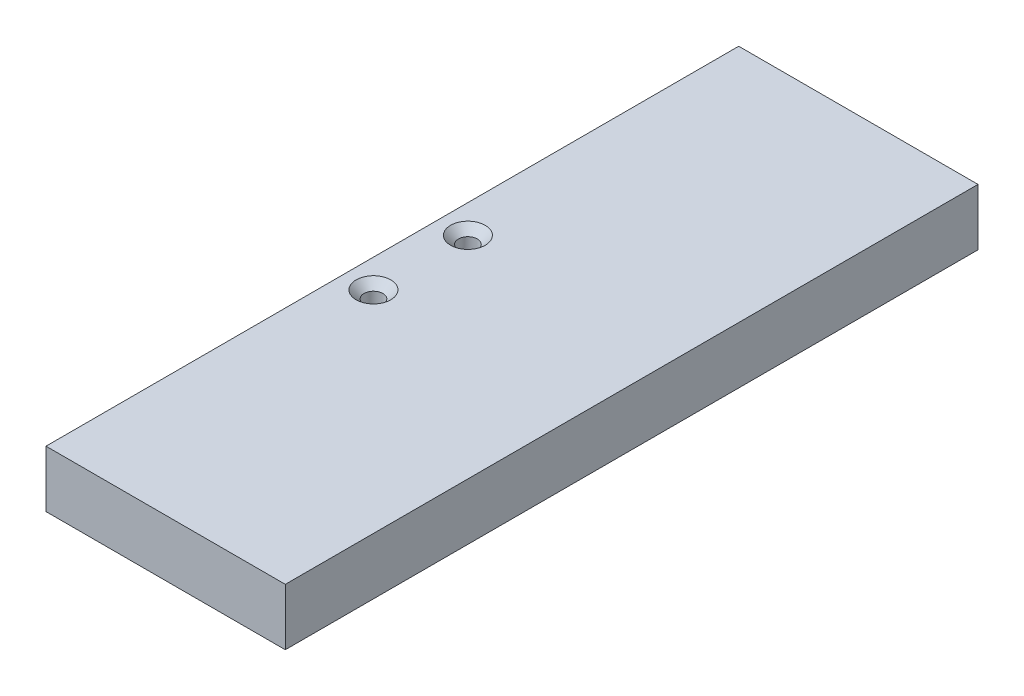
ISO-10303-21;
HEADER;
FILE_DESCRIPTION(('STEP AP214'),'2;1');
FILE_NAME('part.step','',(''),(''),'','','');
FILE_SCHEMA(('AUTOMOTIVE_DESIGN { 1 0 10303 214 1 1 1 1 }'));
ENDSEC;
DATA;
#1=APPLICATION_CONTEXT('core data for automotive mechanical design processes');
#2=APPLICATION_PROTOCOL_DEFINITION('international standard','automotive_design',2000,#1);
#3=PRODUCT_CONTEXT('',#1,'mechanical');
#4=PRODUCT('Part','Part','',(#3));
#5=PRODUCT_RELATED_PRODUCT_CATEGORY('part','',(#4));
#6=PRODUCT_DEFINITION_FORMATION('','',#4);
#7=PRODUCT_DEFINITION_CONTEXT('part definition',#1,'design');
#8=PRODUCT_DEFINITION('design','',#6,#7);
#9=PRODUCT_DEFINITION_SHAPE('','',#8);
#10=(LENGTH_UNIT() NAMED_UNIT(*) SI_UNIT(.MILLI.,.METRE.));
#11=(NAMED_UNIT(*) PLANE_ANGLE_UNIT() SI_UNIT($,.RADIAN.));
#12=(NAMED_UNIT(*) SI_UNIT($,.STERADIAN.) SOLID_ANGLE_UNIT());
#13=UNCERTAINTY_MEASURE_WITH_UNIT(LENGTH_MEASURE(1.E-05),#10,'distance_accuracy_value','');
#14=(GEOMETRIC_REPRESENTATION_CONTEXT(3) GLOBAL_UNCERTAINTY_ASSIGNED_CONTEXT((#13)) GLOBAL_UNIT_ASSIGNED_CONTEXT((#10,
#11,#12)) REPRESENTATION_CONTEXT('',''));
#15=CARTESIAN_POINT('',(0.,0.,0.));
#16=DIRECTION('',(0.,0.,1.));
#17=DIRECTION('',(1.,0.,0.));
#18=AXIS2_PLACEMENT_3D('',#15,#16,#17);
#19=CARTESIAN_POINT('',(-19.,4.5,55.));
#20=DIRECTION('',(1.,0.,0.));
#21=DIRECTION('',(0.,0.,-1.));
#22=AXIS2_PLACEMENT_3D('',#19,#20,#21);
#23=PLANE('',#22);
#24=DIRECTION('',(0.,-1.,0.));
#25=VECTOR('',#24,1.);
#26=CARTESIAN_POINT('',(-19.,4.5,-55.));
#27=LINE('',#26,#25);
#28=CARTESIAN_POINT('',(-19.,4.5,-55.));
#29=VERTEX_POINT('',#28);
#30=CARTESIAN_POINT('',(-19.,-4.5,-55.));
#31=VERTEX_POINT('',#30);
#32=EDGE_CURVE('E99',#29,#31,#27,.T.);
#33=ORIENTED_EDGE('',*,*,#32,.T.);
#34=DIRECTION('',(0.,0.,-1.));
#35=VECTOR('',#34,1.);
#36=CARTESIAN_POINT('',(-19.,-4.5,55.));
#37=LINE('',#36,#35);
#38=CARTESIAN_POINT('',(-19.,-4.5,55.));
#39=VERTEX_POINT('',#38);
#40=EDGE_CURVE('E90',#39,#31,#37,.T.);
#41=ORIENTED_EDGE('',*,*,#40,.F.);
#42=DIRECTION('',(0.,-1.,0.));
#43=VECTOR('',#42,1.);
#44=CARTESIAN_POINT('',(-19.,4.5,55.));
#45=LINE('',#44,#43);
#46=CARTESIAN_POINT('',(-19.,4.5,55.));
#47=VERTEX_POINT('',#46);
#48=EDGE_CURVE('E84',#47,#39,#45,.T.);
#49=ORIENTED_EDGE('',*,*,#48,.F.);
#50=DIRECTION('',(0.,0.,-1.));
#51=VECTOR('',#50,1.);
#52=CARTESIAN_POINT('',(-19.,4.5,55.));
#53=LINE('',#52,#51);
#54=EDGE_CURVE('E95',#47,#29,#53,.T.);
#55=ORIENTED_EDGE('',*,*,#54,.T.);
#56=EDGE_LOOP('',(#33,#41,#49,#55));
#57=FACE_BOUND('',#56,.T.);
#58=ADVANCED_FACE('F31',(#57),#23,.F.);
#59=CARTESIAN_POINT('',(-19.,-4.5,55.));
#60=DIRECTION('',(0.,1.,0.));
#61=DIRECTION('',(0.,0.,1.));
#62=AXIS2_PLACEMENT_3D('',#59,#60,#61);
#63=PLANE('',#62);
#64=CARTESIAN_POINT('',(-14.5,-4.5,7.5));
#65=DIRECTION('',(0.,1.,0.));
#66=DIRECTION('',(0.,0.,1.));
#67=AXIS2_PLACEMENT_3D('',#64,#65,#66);
#68=CIRCLE('',#67,2.75);
#69=CARTESIAN_POINT('',(-14.5,-4.5,10.25));
#70=VERTEX_POINT('',#69);
#71=EDGE_CURVE('E117',#70,#70,#68,.T.);
#72=ORIENTED_EDGE('',*,*,#71,.T.);
#73=EDGE_LOOP('',(#72));
#74=FACE_BOUND('',#73,.T.);
#75=CARTESIAN_POINT('',(-14.5,-4.5,-7.5));
#76=DIRECTION('',(0.,1.,0.));
#77=DIRECTION('',(0.,0.,1.));
#78=AXIS2_PLACEMENT_3D('',#75,#76,#77);
#79=CIRCLE('',#78,2.75);
#80=CARTESIAN_POINT('',(-14.5,-4.5,-4.75));
#81=VERTEX_POINT('',#80);
#82=EDGE_CURVE('E114',#81,#81,#79,.T.);
#83=ORIENTED_EDGE('',*,*,#82,.T.);
#84=EDGE_LOOP('',(#83));
#85=FACE_BOUND('',#84,.T.);
#86=DIRECTION('',(1.,0.,0.));
#87=VECTOR('',#86,1.);
#88=CARTESIAN_POINT('',(-19.,-4.5,-55.));
#89=LINE('',#88,#87);
#90=CARTESIAN_POINT('',(19.,-4.5,-55.));
#91=VERTEX_POINT('',#90);
#92=EDGE_CURVE('E89',#31,#91,#89,.T.);
#93=ORIENTED_EDGE('',*,*,#92,.T.);
#94=DIRECTION('',(0.,0.,-1.));
#95=VECTOR('',#94,1.);
#96=CARTESIAN_POINT('',(19.,-4.5,55.));
#97=LINE('',#96,#95);
#98=CARTESIAN_POINT('',(19.,-4.5,55.));
#99=VERTEX_POINT('',#98);
#100=EDGE_CURVE('E87',#99,#91,#97,.T.);
#101=ORIENTED_EDGE('',*,*,#100,.F.);
#102=DIRECTION('',(1.,0.,0.));
#103=VECTOR('',#102,1.);
#104=CARTESIAN_POINT('',(-19.,-4.5,55.));
#105=LINE('',#104,#103);
#106=EDGE_CURVE('E79',#39,#99,#105,.T.);
#107=ORIENTED_EDGE('',*,*,#106,.F.);
#108=ORIENTED_EDGE('',*,*,#40,.T.);
#109=EDGE_LOOP('',(#93,#101,#107,#108));
#110=FACE_BOUND('',#109,.T.);
#111=ADVANCED_FACE('F88',(#74,#85,#110),#63,.F.);
#112=CARTESIAN_POINT('',(19.,4.5,55.));
#113=DIRECTION('',(-1.,0.,0.));
#114=DIRECTION('',(0.,0.,1.));
#115=AXIS2_PLACEMENT_3D('',#112,#113,#114);
#116=PLANE('',#115);
#117=DIRECTION('',(0.,1.,0.));
#118=VECTOR('',#117,1.);
#119=CARTESIAN_POINT('',(19.,4.5,-55.));
#120=LINE('',#119,#118);
#121=CARTESIAN_POINT('',(19.,4.5,-55.));
#122=VERTEX_POINT('',#121);
#123=EDGE_CURVE('E65',#91,#122,#120,.T.);
#124=ORIENTED_EDGE('',*,*,#123,.T.);
#125=DIRECTION('',(0.,0.,-1.));
#126=VECTOR('',#125,1.);
#127=CARTESIAN_POINT('',(19.,4.5,55.));
#128=LINE('',#127,#126);
#129=CARTESIAN_POINT('',(19.,4.5,55.));
#130=VERTEX_POINT('',#129);
#131=EDGE_CURVE('E91',#130,#122,#128,.T.);
#132=ORIENTED_EDGE('',*,*,#131,.F.);
#133=DIRECTION('',(0.,1.,0.));
#134=VECTOR('',#133,1.);
#135=CARTESIAN_POINT('',(19.,4.5,55.));
#136=LINE('',#135,#134);
#137=EDGE_CURVE('E82',#99,#130,#136,.T.);
#138=ORIENTED_EDGE('',*,*,#137,.F.);
#139=ORIENTED_EDGE('',*,*,#100,.T.);
#140=EDGE_LOOP('',(#124,#132,#138,#139));
#141=FACE_BOUND('',#140,.T.);
#142=ADVANCED_FACE('F93',(#141),#116,.F.);
#143=CARTESIAN_POINT('',(-19.,4.5,55.));
#144=DIRECTION('',(0.,-1.,0.));
#145=DIRECTION('',(0.,0.,-1.));
#146=AXIS2_PLACEMENT_3D('',#143,#144,#145);
#147=PLANE('',#146);
#148=CARTESIAN_POINT('',(-14.5,4.5,7.5));
#149=DIRECTION('',(0.,-1.,0.));
#150=DIRECTION('',(0.,0.,-1.));
#151=AXIS2_PLACEMENT_3D('',#148,#149,#150);
#152=CIRCLE('',#151,2.75000000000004);
#153=CARTESIAN_POINT('',(-14.5,4.5,4.74999999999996));
#154=VERTEX_POINT('',#153);
#155=EDGE_CURVE('E11',#154,#154,#152,.T.);
#156=ORIENTED_EDGE('',*,*,#155,.T.);
#157=EDGE_LOOP('',(#156));
#158=FACE_BOUND('',#157,.T.);
#159=CARTESIAN_POINT('',(-14.5,4.5,-7.5));
#160=DIRECTION('',(0.,-1.,0.));
#161=DIRECTION('',(0.,0.,-1.));
#162=AXIS2_PLACEMENT_3D('',#159,#160,#161);
#163=CIRCLE('',#162,2.75000000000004);
#164=CARTESIAN_POINT('',(-14.5,4.5,-4.74999999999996));
#165=VERTEX_POINT('',#164);
#166=EDGE_CURVE('E40',#165,#165,#163,.T.);
#167=ORIENTED_EDGE('',*,*,#166,.T.);
#168=EDGE_LOOP('',(#167));
#169=FACE_BOUND('',#168,.T.);
#170=DIRECTION('',(-1.,0.,0.));
#171=VECTOR('',#170,1.);
#172=CARTESIAN_POINT('',(-19.,4.5,-55.));
#173=LINE('',#172,#171);
#174=EDGE_CURVE('E71',#122,#29,#173,.T.);
#175=ORIENTED_EDGE('',*,*,#174,.T.);
#176=ORIENTED_EDGE('',*,*,#54,.F.);
#177=DIRECTION('',(-1.,0.,0.));
#178=VECTOR('',#177,1.);
#179=CARTESIAN_POINT('',(-19.,4.5,55.));
#180=LINE('',#179,#178);
#181=EDGE_CURVE('E48',#130,#47,#180,.T.);
#182=ORIENTED_EDGE('',*,*,#181,.F.);
#183=ORIENTED_EDGE('',*,*,#131,.T.);
#184=EDGE_LOOP('',(#175,#176,#182,#183));
#185=FACE_BOUND('',#184,.T.);
#186=ADVANCED_FACE('F128',(#158,#169,#185),#147,.F.);
#187=CARTESIAN_POINT('',(-19.,-4.5,55.));
#188=DIRECTION('',(0.,0.,1.));
#189=DIRECTION('',(1.,0.,0.));
#190=AXIS2_PLACEMENT_3D('',#187,#188,#189);
#191=PLANE('',#190);
#192=ORIENTED_EDGE('',*,*,#48,.T.);
#193=ORIENTED_EDGE('',*,*,#106,.T.);
#194=ORIENTED_EDGE('',*,*,#137,.T.);
#195=ORIENTED_EDGE('',*,*,#181,.T.);
#196=EDGE_LOOP('',(#192,#193,#194,#195));
#197=FACE_BOUND('',#196,.T.);
#198=ADVANCED_FACE('F80',(#197),#191,.T.);
#199=CARTESIAN_POINT('',(-19.,-4.5,-55.));
#200=DIRECTION('',(0.,0.,1.));
#201=DIRECTION('',(1.,0.,0.));
#202=AXIS2_PLACEMENT_3D('',#199,#200,#201);
#203=PLANE('',#202);
#204=ORIENTED_EDGE('',*,*,#32,.F.);
#205=ORIENTED_EDGE('',*,*,#174,.F.);
#206=ORIENTED_EDGE('',*,*,#123,.F.);
#207=ORIENTED_EDGE('',*,*,#92,.F.);
#208=EDGE_LOOP('',(#204,#205,#206,#207));
#209=FACE_BOUND('',#208,.T.);
#210=ADVANCED_FACE('F138',(#209),#203,.F.);
#211=CARTESIAN_POINT('',(-14.5,-4.501,-7.5));
#212=DIRECTION('',(0.,1.,0.));
#213=DIRECTION('',(0.,0.,1.));
#214=AXIS2_PLACEMENT_3D('',#211,#212,#213);
#215=CYLINDRICAL_SURFACE('',#214,1.5);
#216=CARTESIAN_POINT('',(-14.5,-3.25,-7.5));
#217=DIRECTION('',(0.,1.,0.));
#218=DIRECTION('',(0.,0.,1.));
#219=AXIS2_PLACEMENT_3D('',#216,#217,#218);
#220=CIRCLE('',#219,1.5);
#221=CARTESIAN_POINT('',(-14.5,-3.25,-6.));
#222=VERTEX_POINT('',#221);
#223=EDGE_CURVE('E123',#222,#222,#220,.F.);
#224=ORIENTED_EDGE('',*,*,#223,.T.);
#225=EDGE_LOOP('',(#224));
#226=FACE_BOUND('',#225,.T.);
#227=CARTESIAN_POINT('',(-14.5,3.24999999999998,-7.5));
#228=DIRECTION('',(0.,-1.,0.));
#229=DIRECTION('',(0.,0.,-1.));
#230=AXIS2_PLACEMENT_3D('',#227,#228,#229);
#231=CIRCLE('',#230,1.5);
#232=CARTESIAN_POINT('',(-14.5,3.24999999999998,-6.));
#233=VERTEX_POINT('',#232);
#234=EDGE_CURVE('E120',#233,#233,#231,.F.);
#235=ORIENTED_EDGE('',*,*,#234,.T.);
#236=EDGE_LOOP('',(#235));
#237=FACE_BOUND('',#236,.T.);
#238=ADVANCED_FACE('F135',(#226,#237),#215,.F.);
#239=CARTESIAN_POINT('',(-14.5,-4.501,7.5));
#240=DIRECTION('',(0.,1.,0.));
#241=DIRECTION('',(0.,0.,1.));
#242=AXIS2_PLACEMENT_3D('',#239,#240,#241);
#243=CYLINDRICAL_SURFACE('',#242,1.5);
#244=CARTESIAN_POINT('',(-14.5,-3.24999999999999,7.5));
#245=DIRECTION('',(0.,1.,0.));
#246=DIRECTION('',(0.,0.,1.));
#247=AXIS2_PLACEMENT_3D('',#244,#245,#246);
#248=CIRCLE('',#247,1.5);
#249=CARTESIAN_POINT('',(-14.5,-3.24999999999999,9.));
#250=VERTEX_POINT('',#249);
#251=EDGE_CURVE('E111',#250,#250,#248,.F.);
#252=ORIENTED_EDGE('',*,*,#251,.T.);
#253=EDGE_LOOP('',(#252));
#254=FACE_BOUND('',#253,.T.);
#255=CARTESIAN_POINT('',(-14.5,3.24999999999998,7.5));
#256=DIRECTION('',(0.,-1.,0.));
#257=DIRECTION('',(0.,0.,-1.));
#258=AXIS2_PLACEMENT_3D('',#255,#256,#257);
#259=CIRCLE('',#258,1.5);
#260=CARTESIAN_POINT('',(-14.5,3.24999999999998,6.));
#261=VERTEX_POINT('',#260);
#262=EDGE_CURVE('E108',#261,#261,#259,.F.);
#263=ORIENTED_EDGE('',*,*,#262,.T.);
#264=EDGE_LOOP('',(#263));
#265=FACE_BOUND('',#264,.T.);
#266=ADVANCED_FACE('F137',(#254,#265),#243,.F.);
#267=CARTESIAN_POINT('',(-14.5,-3.24999999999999,7.5));
#268=DIRECTION('',(0.,-1.,0.));
#269=DIRECTION('',(0.,0.,-1.));
#270=AXIS2_PLACEMENT_3D('',#267,#268,#269);
#271=CONICAL_SURFACE('',#270,1.5,0.785398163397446);
#272=ORIENTED_EDGE('',*,*,#71,.F.);
#273=EDGE_LOOP('',(#272));
#274=FACE_BOUND('',#273,.T.);
#275=ORIENTED_EDGE('',*,*,#251,.F.);
#276=EDGE_LOOP('',(#275));
#277=FACE_BOUND('',#276,.T.);
#278=ADVANCED_FACE('F145',(#274,#277),#271,.F.);
#279=CARTESIAN_POINT('',(-14.5,-3.25,-7.5));
#280=DIRECTION('',(0.,-1.,0.));
#281=DIRECTION('',(0.,0.,-1.));
#282=AXIS2_PLACEMENT_3D('',#279,#280,#281);
#283=CONICAL_SURFACE('',#282,1.5,0.785398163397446);
#284=ORIENTED_EDGE('',*,*,#82,.F.);
#285=EDGE_LOOP('',(#284));
#286=FACE_BOUND('',#285,.T.);
#287=ORIENTED_EDGE('',*,*,#223,.F.);
#288=EDGE_LOOP('',(#287));
#289=FACE_BOUND('',#288,.T.);
#290=ADVANCED_FACE('F163',(#286,#289),#283,.F.);
#291=CARTESIAN_POINT('',(-14.5,3.24999999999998,7.5));
#292=DIRECTION('',(0.,1.,0.));
#293=DIRECTION('',(0.,0.,1.));
#294=AXIS2_PLACEMENT_3D('',#291,#292,#293);
#295=CONICAL_SURFACE('',#294,1.5,0.785398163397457);
#296=ORIENTED_EDGE('',*,*,#155,.F.);
#297=EDGE_LOOP('',(#296));
#298=FACE_BOUND('',#297,.T.);
#299=ORIENTED_EDGE('',*,*,#262,.F.);
#300=EDGE_LOOP('',(#299));
#301=FACE_BOUND('',#300,.T.);
#302=ADVANCED_FACE('F132',(#298,#301),#295,.F.);
#303=CARTESIAN_POINT('',(-14.5,3.24999999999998,-7.5));
#304=DIRECTION('',(0.,1.,0.));
#305=DIRECTION('',(0.,0.,1.));
#306=AXIS2_PLACEMENT_3D('',#303,#304,#305);
#307=CONICAL_SURFACE('',#306,1.5,0.785398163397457);
#308=CARTESIAN_POINT('',(-14.5,4.5,-4.74999999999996));
#309=CARTESIAN_POINT('',(-14.5,4.48697916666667,-4.76302083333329));
#310=CARTESIAN_POINT('',(-14.5,4.47395833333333,-4.77604166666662));
#311=CARTESIAN_POINT('',(-14.5,4.44791666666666,-4.80208333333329));
#312=CARTESIAN_POINT('',(-14.5,4.43489583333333,-4.81510416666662));
#313=CARTESIAN_POINT('',(-14.5,4.40885416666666,-4.84114583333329));
#314=CARTESIAN_POINT('',(-14.5,4.39583333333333,-4.85416666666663));
#315=CARTESIAN_POINT('',(-14.5,4.36979166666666,-4.88020833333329));
#316=CARTESIAN_POINT('',(-14.5,4.35677083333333,-4.89322916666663));
#317=CARTESIAN_POINT('',(-14.5,4.33072916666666,-4.91927083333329));
#318=CARTESIAN_POINT('',(-14.5,4.31770833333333,-4.93229166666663));
#319=CARTESIAN_POINT('',(-14.5,4.29166666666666,-4.9583333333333));
#320=CARTESIAN_POINT('',(-14.5,4.27864583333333,-4.97135416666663));
#321=CARTESIAN_POINT('',(-14.5,4.25260416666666,-4.9973958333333));
#322=CARTESIAN_POINT('',(-14.5,4.23958333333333,-5.01041666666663));
#323=CARTESIAN_POINT('',(-14.5,4.21354166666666,-5.0364583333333));
#324=CARTESIAN_POINT('',(-14.5,4.20052083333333,-5.04947916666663));
#325=CARTESIAN_POINT('',(-14.5,4.17447916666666,-5.0755208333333));
#326=CARTESIAN_POINT('',(-14.5,4.16145833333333,-5.08854166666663));
#327=CARTESIAN_POINT('',(-14.5,4.13541666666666,-5.1145833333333));
#328=CARTESIAN_POINT('',(-14.5,4.12239583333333,-5.12760416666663));
#329=CARTESIAN_POINT('',(-14.5,4.09635416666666,-5.1536458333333));
#330=CARTESIAN_POINT('',(-14.5,4.08333333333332,-5.16666666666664));
#331=CARTESIAN_POINT('',(-14.5,4.05729166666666,-5.1927083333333));
#332=CARTESIAN_POINT('',(-14.5,4.04427083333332,-5.20572916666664));
#333=CARTESIAN_POINT('',(-14.5,4.01822916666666,-5.2317708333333));
#334=CARTESIAN_POINT('',(-14.5,4.00520833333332,-5.24479166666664));
#335=CARTESIAN_POINT('',(-14.5,3.97916666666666,-5.27083333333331));
#336=CARTESIAN_POINT('',(-14.5,3.96614583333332,-5.28385416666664));
#337=CARTESIAN_POINT('',(-14.5,3.94010416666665,-5.30989583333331));
#338=CARTESIAN_POINT('',(-14.5,3.92708333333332,-5.32291666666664));
#339=CARTESIAN_POINT('',(-14.5,3.90104166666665,-5.34895833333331));
#340=CARTESIAN_POINT('',(-14.5,3.88802083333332,-5.36197916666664));
#341=CARTESIAN_POINT('',(-14.5,3.86197916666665,-5.38802083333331));
#342=CARTESIAN_POINT('',(-14.5,3.84895833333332,-5.40104166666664));
#343=CARTESIAN_POINT('',(-14.5,3.82291666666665,-5.42708333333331));
#344=CARTESIAN_POINT('',(-14.5,3.80989583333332,-5.44010416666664));
#345=CARTESIAN_POINT('',(-14.5,3.78385416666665,-5.46614583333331));
#346=CARTESIAN_POINT('',(-14.5,3.77083333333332,-5.47916666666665));
#347=CARTESIAN_POINT('',(-14.5,3.74479166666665,-5.50520833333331));
#348=CARTESIAN_POINT('',(-14.5,3.73177083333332,-5.51822916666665));
#349=CARTESIAN_POINT('',(-14.5,3.70572916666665,-5.54427083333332));
#350=CARTESIAN_POINT('',(-14.5,3.69270833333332,-5.55729166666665));
#351=CARTESIAN_POINT('',(-14.5,3.66666666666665,-5.58333333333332));
#352=CARTESIAN_POINT('',(-14.5,3.65364583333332,-5.59635416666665));
#353=CARTESIAN_POINT('',(-14.5,3.62760416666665,-5.62239583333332));
#354=CARTESIAN_POINT('',(-14.5,3.61458333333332,-5.63541666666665));
#355=CARTESIAN_POINT('',(-14.5,3.58854166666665,-5.66145833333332));
#356=CARTESIAN_POINT('',(-14.5,3.57552083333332,-5.67447916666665));
#357=CARTESIAN_POINT('',(-14.5,3.54947916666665,-5.70052083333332));
#358=CARTESIAN_POINT('',(-14.5,3.53645833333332,-5.71354166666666));
#359=CARTESIAN_POINT('',(-14.5,3.51041666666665,-5.73958333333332));
#360=CARTESIAN_POINT('',(-14.5,3.49739583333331,-5.75260416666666));
#361=CARTESIAN_POINT('',(-14.5,3.47135416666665,-5.77864583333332));
#362=CARTESIAN_POINT('',(-14.5,3.45833333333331,-5.79166666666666));
#363=CARTESIAN_POINT('',(-14.5,3.43229166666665,-5.81770833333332));
#364=CARTESIAN_POINT('',(-14.5,3.41927083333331,-5.83072916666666));
#365=CARTESIAN_POINT('',(-14.5,3.39322916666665,-5.85677083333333));
#366=CARTESIAN_POINT('',(-14.5,3.38020833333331,-5.86979166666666));
#367=CARTESIAN_POINT('',(-14.5,3.35416666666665,-5.89583333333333));
#368=CARTESIAN_POINT('',(-14.5,3.34114583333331,-5.90885416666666));
#369=CARTESIAN_POINT('',(-14.5,3.31510416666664,-5.93489583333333));
#370=CARTESIAN_POINT('',(-14.5,3.30208333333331,-5.94791666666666));
#371=CARTESIAN_POINT('',(-14.5,3.27604166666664,-5.97395833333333));
#372=CARTESIAN_POINT('',(-14.5,3.26302083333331,-5.98697916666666));
#373=CARTESIAN_POINT('',(-14.5,3.24999999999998,-6.));
#374=B_SPLINE_CURVE_WITH_KNOTS('',3,(#308,#309,#310,#311,#312,#313,#314,#315,#316,#317,#318,
#319,#320,#321,#322,#323,#324,#325,#326,#327,#328,#329,#330,#331,#332,#333,#334,#335,#336,#337,
#338,#339,#340,#341,#342,#343,#344,#345,#346,#347,#348,#349,#350,#351,#352,#353,#354,#355,#356,
#357,#358,#359,#360,#361,#362,#363,#364,#365,#366,#367,#368,#369,#370,#371,#372,#373),
.UNSPECIFIED.,.F.,.F.,(4,2,2,2,2,2,2,2,2,2,2,2,2,2,2,2,2,2,2,2,2,2,2,2,2,2,2,2,2,2,2,2,4),(0.,
0.0552427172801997,0.1104854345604,0.165728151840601,0.220970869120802,0.276213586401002,
0.331456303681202,0.386699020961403,0.441941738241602,0.497184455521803,0.552427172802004,
0.607669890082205,0.662912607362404,0.718155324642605,0.773398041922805,0.828640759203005,
0.883883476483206,0.939126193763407,0.994368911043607,1.04961162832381,1.10485434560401,
1.16009706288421,1.21533978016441,1.27058249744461,1.32582521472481,1.38106793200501,
1.43631064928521,1.49155336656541,1.54679608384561,1.60203880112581,1.65728151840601,
1.71252423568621,1.76776695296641),.UNSPECIFIED.);
#375=EDGE_CURVE('BSEAM33',#165,#233,#374,.T.);
#376=ORIENTED_EDGE('',*,*,#166,.F.);
#377=ORIENTED_EDGE('',*,*,#234,.F.);
#378=ORIENTED_EDGE('',*,*,#375,.T.);
#379=ORIENTED_EDGE('',*,*,#375,.F.);
#380=EDGE_LOOP('',(#376,#378,#377,#379));
#381=FACE_BOUND('',#380,.T.);
#382=ADVANCED_FACE('F33',(#381),#307,.F.);
#383=CLOSED_SHELL('',(#58,#111,#142,#186,#198,#210,#238,#266,#278,#290,#302,#382));
#384=MANIFOLD_SOLID_BREP('B2',#383);
#385=ADVANCED_BREP_SHAPE_REPRESENTATION('',(#18,#384),#14);
#386=SHAPE_DEFINITION_REPRESENTATION(#9,#385);
ENDSEC;
END-ISO-10303-21;
